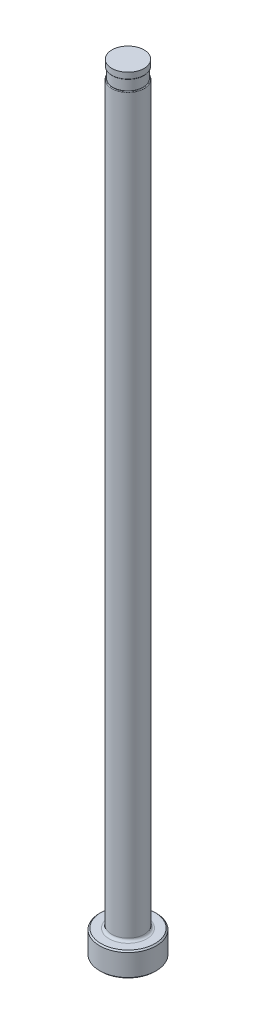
ISO-10303-21;
HEADER;
FILE_DESCRIPTION(('STEP AP214'),'2;1');
FILE_NAME('part.step','',(''),(''),'','','');
FILE_SCHEMA(('AUTOMOTIVE_DESIGN { 1 0 10303 214 1 1 1 1 }'));
ENDSEC;
DATA;
#1=APPLICATION_CONTEXT('core data for automotive mechanical design processes');
#2=APPLICATION_PROTOCOL_DEFINITION('international standard','automotive_design',2000,#1);
#3=PRODUCT_CONTEXT('',#1,'mechanical');
#4=PRODUCT('Part','Part','',(#3));
#5=PRODUCT_RELATED_PRODUCT_CATEGORY('part','',(#4));
#6=PRODUCT_DEFINITION_FORMATION('','',#4);
#7=PRODUCT_DEFINITION_CONTEXT('part definition',#1,'design');
#8=PRODUCT_DEFINITION('design','',#6,#7);
#9=PRODUCT_DEFINITION_SHAPE('','',#8);
#10=(LENGTH_UNIT() NAMED_UNIT(*) SI_UNIT(.MILLI.,.METRE.));
#11=(NAMED_UNIT(*) PLANE_ANGLE_UNIT() SI_UNIT($,.RADIAN.));
#12=(NAMED_UNIT(*) SI_UNIT($,.STERADIAN.) SOLID_ANGLE_UNIT());
#13=UNCERTAINTY_MEASURE_WITH_UNIT(LENGTH_MEASURE(1.E-05),#10,'distance_accuracy_value','');
#14=(GEOMETRIC_REPRESENTATION_CONTEXT(3) GLOBAL_UNCERTAINTY_ASSIGNED_CONTEXT((#13)) GLOBAL_UNIT_ASSIGNED_CONTEXT((#10,
#11,#12)) REPRESENTATION_CONTEXT('',''));
#15=CARTESIAN_POINT('',(0.,0.,0.));
#16=DIRECTION('',(0.,0.,1.));
#17=DIRECTION('',(1.,0.,0.));
#18=AXIS2_PLACEMENT_3D('',#15,#16,#17);
#19=CARTESIAN_POINT('',(-3.17499999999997,151.13,0.));
#20=DIRECTION('',(0.,1.,0.));
#21=DIRECTION('',(0.,0.,1.));
#22=AXIS2_PLACEMENT_3D('',#19,#20,#21);
#23=PLANE('',#22);
#24=CARTESIAN_POINT('',(0.,151.13,0.));
#25=DIRECTION('',(0.,1.,0.));
#26=DIRECTION('',(0.,0.,1.));
#27=AXIS2_PLACEMENT_3D('',#24,#25,#26);
#28=CIRCLE('',#27,3.02894999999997);
#29=CARTESIAN_POINT('',(0.,151.13,3.02894999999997));
#30=VERTEX_POINT('',#29);
#31=EDGE_CURVE('E11',#30,#30,#28,.F.);
#32=ORIENTED_EDGE('',*,*,#31,.T.);
#33=EDGE_LOOP('',(#32));
#34=FACE_BOUND('',#33,.T.);
#35=CARTESIAN_POINT('',(0.,151.13,0.));
#36=DIRECTION('',(0.,1.,0.));
#37=DIRECTION('',(0.,0.,1.));
#38=AXIS2_PLACEMENT_3D('',#35,#36,#37);
#39=CIRCLE('',#38,2.97179999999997);
#40=CARTESIAN_POINT('',(0.,151.13,2.97179999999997));
#41=VERTEX_POINT('',#40);
#42=EDGE_CURVE('E78',#41,#41,#39,.T.);
#43=ORIENTED_EDGE('',*,*,#42,.T.);
#44=EDGE_LOOP('',(#43));
#45=FACE_BOUND('',#44,.T.);
#46=ADVANCED_FACE('F36',(#34,#45),#23,.F.);
#47=CARTESIAN_POINT('',(0.,259.958771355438,0.));
#48=DIRECTION('',(0.,1.,0.));
#49=DIRECTION('',(0.,0.,1.));
#50=AXIS2_PLACEMENT_3D('',#47,#48,#49);
#51=CYLINDRICAL_SURFACE('',#50,3.17499999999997);
#52=DIRECTION('',(0.,1.,0.));
#53=VECTOR('',#52,1.);
#54=CARTESIAN_POINT('',(-2.97179999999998,259.958771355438,-1.11759999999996));
#55=LINE('',#54,#53);
#56=CARTESIAN_POINT('',(-2.97179999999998,148.971,-1.11759999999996));
#57=VERTEX_POINT('',#56);
#58=CARTESIAN_POINT('',(-2.97179999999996,86.614,-1.11760000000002));
#59=VERTEX_POINT('',#58);
#60=EDGE_CURVE('E73',#57,#59,#55,.F.);
#61=ORIENTED_EDGE('',*,*,#60,.F.);
#62=CARTESIAN_POINT('',(0.,148.971,0.));
#63=DIRECTION('',(0.,-1.,0.));
#64=DIRECTION('',(0.,0.,-1.));
#65=AXIS2_PLACEMENT_3D('',#62,#63,#64);
#66=CIRCLE('',#65,3.17499999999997);
#67=CARTESIAN_POINT('',(-2.97179999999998,148.971,1.11759999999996));
#68=VERTEX_POINT('',#67);
#69=EDGE_CURVE('E51',#57,#68,#66,.T.);
#70=ORIENTED_EDGE('',*,*,#69,.T.);
#71=DIRECTION('',(0.,1.,0.));
#72=VECTOR('',#71,1.);
#73=CARTESIAN_POINT('',(-2.97179999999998,259.958771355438,1.11759999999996));
#74=LINE('',#73,#72);
#75=CARTESIAN_POINT('',(-2.97179999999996,86.614,1.11760000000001));
#76=VERTEX_POINT('',#75);
#77=EDGE_CURVE('E84',#76,#68,#74,.T.);
#78=ORIENTED_EDGE('',*,*,#77,.F.);
#79=CARTESIAN_POINT('',(-2.97179999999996,86.614,-1.11760000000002));
#80=CARTESIAN_POINT('',(-2.97179783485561,86.5828492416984,-1.11759841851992));
#81=CARTESIAN_POINT('',(-2.97225900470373,86.5517131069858,-1.11638031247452));
#82=CARTESIAN_POINT('',(-2.97408412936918,86.4896581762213,-1.11151181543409));
#83=CARTESIAN_POINT('',(-2.9754480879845,86.4587393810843,-1.10786141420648));
#84=CARTESIAN_POINT('',(-2.98085437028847,86.3666586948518,-1.09327356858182));
#85=CARTESIAN_POINT('',(-2.98621120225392,86.3061035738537,-1.07869946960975));
#86=CARTESIAN_POINT('',(-2.99989040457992,86.1884361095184,-1.0400472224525));
#87=CARTESIAN_POINT('',(-3.0082151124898,86.131326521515,-1.01596158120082));
#88=CARTESIAN_POINT('',(-3.02694285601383,86.022241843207,-0.958720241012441));
#89=CARTESIAN_POINT('',(-3.03734492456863,85.9702643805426,-0.925568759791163));
#90=CARTESIAN_POINT('',(-3.0590244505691,85.8732383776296,-0.851164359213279));
#91=CARTESIAN_POINT('',(-3.07029576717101,85.828146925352,-0.809965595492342));
#92=CARTESIAN_POINT('',(-3.09254226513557,85.7456893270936,-0.720370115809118));
#93=CARTESIAN_POINT('',(-3.10351739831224,85.7083244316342,-0.671972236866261));
#94=CARTESIAN_POINT('',(-3.12390298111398,85.6424529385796,-0.569694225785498));
#95=CARTESIAN_POINT('',(-3.13332395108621,85.6138855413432,-0.515855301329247));
#96=CARTESIAN_POINT('',(-3.14970808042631,85.5658047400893,-0.403931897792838));
#97=CARTESIAN_POINT('',(-3.15667118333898,85.5462915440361,-0.345847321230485));
#98=CARTESIAN_POINT('',(-3.16748231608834,85.5164813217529,-0.226501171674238));
#99=CARTESIAN_POINT('',(-3.171300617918,85.5062721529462,-0.165214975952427));
#100=CARTESIAN_POINT('',(-3.17532797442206,85.4955133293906,-0.0416799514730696));
#101=CARTESIAN_POINT('',(-3.17553664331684,85.4949647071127,0.0205689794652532));
#102=CARTESIAN_POINT('',(-3.17230405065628,85.5035855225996,0.145017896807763));
#103=CARTESIAN_POINT('',(-3.16882082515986,85.5128666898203,0.207209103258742));
#104=CARTESIAN_POINT('',(-3.15849643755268,85.5412036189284,0.329033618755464));
#105=CARTESIAN_POINT('',(-3.15165544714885,85.5602588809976,0.388667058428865));
#106=CARTESIAN_POINT('',(-3.13536379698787,85.6077683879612,0.503459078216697));
#107=CARTESIAN_POINT('',(-3.12592155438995,85.6361923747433,0.558631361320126));
#108=CARTESIAN_POINT('',(-3.10544176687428,85.7018905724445,0.663093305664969));
#109=CARTESIAN_POINT('',(-3.0944044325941,85.7391636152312,0.712383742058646));
#110=CARTESIAN_POINT('',(-3.07210838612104,85.821112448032,0.803076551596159));
#111=CARTESIAN_POINT('',(-3.06085457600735,85.8656831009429,0.844575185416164));
#112=CARTESIAN_POINT('',(-3.03920760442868,85.9613924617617,0.919437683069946));
#113=CARTESIAN_POINT('',(-3.02881454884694,86.012531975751,0.95280054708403));
#114=CARTESIAN_POINT('',(-3.01003274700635,86.1197633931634,1.01056985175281));
#115=CARTESIAN_POINT('',(-3.00163816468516,86.1758402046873,1.03500248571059));
#116=CARTESIAN_POINT('',(-2.987687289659,86.2914874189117,1.0746137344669));
#117=CARTESIAN_POINT('',(-2.98212915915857,86.3510555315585,1.08979834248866));
#118=CARTESIAN_POINT('',(-2.97612776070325,86.4449133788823,1.10603958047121));
#119=CARTESIAN_POINT('',(-2.97450869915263,86.478597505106,1.11037745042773));
#120=CARTESIAN_POINT('',(-2.97234395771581,86.5461830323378,1.11615426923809));
#121=CARTESIAN_POINT('',(-2.97179623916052,86.580083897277,1.1175987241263));
#122=CARTESIAN_POINT('',(-2.97179999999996,86.614,1.11760000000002));
#123=B_SPLINE_CURVE_WITH_KNOTS('',3,(#79,#80,#81,#82,#83,#84,#85,#86,#87,#88,#89,#90,#91,#92,
#93,#94,#95,#96,#97,#98,#99,#100,#101,#102,#103,#104,#105,#106,#107,#108,#109,#110,#111,#112,
#113,#114,#115,#116,#117,#118,#119,#120,#121,#122),.UNSPECIFIED.,.F.,.F.,(4,2,2,2,2,2,2,2,2,2,2,
2,2,2,2,2,2,2,2,2,2,4),(0.,0.0933958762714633,0.186792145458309,0.373380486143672,
0.56011611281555,0.746765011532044,0.932198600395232,1.11766217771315,1.30181365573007,
1.48596936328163,1.67184654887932,1.85774359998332,2.04577654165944,2.23379986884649,
2.42122179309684,2.60861899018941,2.7935218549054,2.97844743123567,3.162826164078,
3.34708528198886,3.448962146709,3.55064495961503),.UNSPECIFIED.);
#124=EDGE_CURVE('E81',#59,#76,#123,.T.);
#125=ORIENTED_EDGE('',*,*,#124,.F.);
#126=EDGE_LOOP('',(#61,#70,#78,#125));
#127=FACE_BOUND('',#126,.T.);
#128=CARTESIAN_POINT('',(0.,5.25779999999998,0.));
#129=DIRECTION('',(0.,1.,0.));
#130=DIRECTION('',(0.,0.,1.));
#131=AXIS2_PLACEMENT_3D('',#128,#129,#130);
#132=CIRCLE('',#131,3.17499999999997);
#133=CARTESIAN_POINT('',(0.,5.25779999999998,3.17499999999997));
#134=VERTEX_POINT('',#133);
#135=EDGE_CURVE('E116',#134,#134,#132,.T.);
#136=ORIENTED_EDGE('',*,*,#135,.T.);
#137=EDGE_LOOP('',(#136));
#138=FACE_BOUND('',#137,.T.);
#139=ADVANCED_FACE('F82',(#127,#138),#51,.T.);
#140=CARTESIAN_POINT('',(0.,0.,0.));
#141=DIRECTION('',(0.,-1.,0.));
#142=DIRECTION('',(0.,0.,-1.));
#143=AXIS2_PLACEMENT_3D('',#140,#141,#142);
#144=PLANE('',#143);
#145=CARTESIAN_POINT('',(0.,0.,0.));
#146=DIRECTION('',(0.,-1.,0.));
#147=DIRECTION('',(0.,0.,-1.));
#148=AXIS2_PLACEMENT_3D('',#145,#146,#147);
#149=CIRCLE('',#148,5.29589999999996);
#150=CARTESIAN_POINT('',(0.,0.,-5.29589999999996));
#151=VERTEX_POINT('',#150);
#152=EDGE_CURVE('E113',#151,#151,#149,.T.);
#153=ORIENTED_EDGE('',*,*,#152,.T.);
#154=EDGE_LOOP('',(#153));
#155=FACE_BOUND('',#154,.T.);
#156=ADVANCED_FACE('F192',(#155),#144,.T.);
#157=CARTESIAN_POINT('',(0.,259.958771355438,0.));
#158=DIRECTION('',(0.,1.,0.));
#159=DIRECTION('',(0.,0.,1.));
#160=AXIS2_PLACEMENT_3D('',#157,#158,#159);
#161=CYLINDRICAL_SURFACE('',#160,5.54989999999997);
#162=CARTESIAN_POINT('',(0.,4.49579999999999,0.));
#163=DIRECTION('',(0.,1.,0.));
#164=DIRECTION('',(0.,0.,1.));
#165=AXIS2_PLACEMENT_3D('',#162,#163,#164);
#166=CIRCLE('',#165,5.54989999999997);
#167=CARTESIAN_POINT('',(0.,4.49579999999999,5.54989999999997));
#168=VERTEX_POINT('',#167);
#169=EDGE_CURVE('E110',#168,#168,#166,.F.);
#170=ORIENTED_EDGE('',*,*,#169,.T.);
#171=EDGE_LOOP('',(#170));
#172=FACE_BOUND('',#171,.T.);
#173=CARTESIAN_POINT('',(0.,0.253999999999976,0.));
#174=DIRECTION('',(0.,-1.,0.));
#175=DIRECTION('',(0.,0.,-1.));
#176=AXIS2_PLACEMENT_3D('',#173,#174,#175);
#177=CIRCLE('',#176,5.54989999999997);
#178=CARTESIAN_POINT('',(0.,0.253999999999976,-5.54989999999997));
#179=VERTEX_POINT('',#178);
#180=EDGE_CURVE('E107',#179,#179,#177,.F.);
#181=ORIENTED_EDGE('',*,*,#180,.T.);
#182=EDGE_LOOP('',(#181));
#183=FACE_BOUND('',#182,.T.);
#184=ADVANCED_FACE('F195',(#172,#183),#161,.T.);
#185=CARTESIAN_POINT('',(-5.54989999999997,4.7498,0.));
#186=DIRECTION('',(0.,1.,0.));
#187=DIRECTION('',(0.,0.,1.));
#188=AXIS2_PLACEMENT_3D('',#185,#186,#187);
#189=PLANE('',#188);
#190=CARTESIAN_POINT('',(0.,4.7498,0.));
#191=DIRECTION('',(0.,1.,0.));
#192=DIRECTION('',(0.,0.,1.));
#193=AXIS2_PLACEMENT_3D('',#190,#191,#192);
#194=CIRCLE('',#193,3.68299999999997);
#195=CARTESIAN_POINT('',(0.,4.7498,3.68299999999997));
#196=VERTEX_POINT('',#195);
#197=EDGE_CURVE('E87',#196,#196,#194,.F.);
#198=ORIENTED_EDGE('',*,*,#197,.T.);
#199=EDGE_LOOP('',(#198));
#200=FACE_BOUND('',#199,.T.);
#201=CARTESIAN_POINT('',(0.,4.7498,0.));
#202=DIRECTION('',(0.,1.,0.));
#203=DIRECTION('',(0.,0.,1.));
#204=AXIS2_PLACEMENT_3D('',#201,#202,#203);
#205=CIRCLE('',#204,5.29589999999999);
#206=CARTESIAN_POINT('',(0.,4.7498,5.29589999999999));
#207=VERTEX_POINT('',#206);
#208=EDGE_CURVE('E104',#207,#207,#205,.T.);
#209=ORIENTED_EDGE('',*,*,#208,.T.);
#210=EDGE_LOOP('',(#209));
#211=FACE_BOUND('',#210,.T.);
#212=ADVANCED_FACE('F190',(#200,#211),#189,.T.);
#213=CARTESIAN_POINT('',(0.,4.74980000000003,0.));
#214=DIRECTION('',(0.,-1.,0.));
#215=DIRECTION('',(0.,0.,-1.));
#216=AXIS2_PLACEMENT_3D('',#213,#214,#215);
#217=CONICAL_SURFACE('',#216,5.29589999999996,0.785398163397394);
#218=ORIENTED_EDGE('',*,*,#169,.F.);
#219=EDGE_LOOP('',(#218));
#220=FACE_BOUND('',#219,.T.);
#221=ORIENTED_EDGE('',*,*,#208,.F.);
#222=EDGE_LOOP('',(#221));
#223=FACE_BOUND('',#222,.T.);
#224=ADVANCED_FACE('F186',(#220,#223),#217,.T.);
#225=CARTESIAN_POINT('',(0.,0.253999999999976,0.));
#226=DIRECTION('',(0.,1.,0.));
#227=DIRECTION('',(0.,0.,1.));
#228=AXIS2_PLACEMENT_3D('',#225,#226,#227);
#229=CONICAL_SURFACE('',#228,5.54989999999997,0.785398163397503);
#230=ORIENTED_EDGE('',*,*,#152,.F.);
#231=EDGE_LOOP('',(#230));
#232=FACE_BOUND('',#231,.T.);
#233=ORIENTED_EDGE('',*,*,#180,.F.);
#234=EDGE_LOOP('',(#233));
#235=FACE_BOUND('',#234,.T.);
#236=ADVANCED_FACE('F182',(#232,#235),#229,.T.);
#237=CARTESIAN_POINT('',(0.,5.25779999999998,0.));
#238=DIRECTION('',(0.,1.,0.));
#239=DIRECTION('',(0.,0.,1.));
#240=AXIS2_PLACEMENT_3D('',#237,#238,#239);
#241=TOROIDAL_SURFACE('',#240,3.68299999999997,0.508);
#242=ORIENTED_EDGE('',*,*,#197,.F.);
#243=EDGE_LOOP('',(#242));
#244=FACE_BOUND('',#243,.T.);
#245=ORIENTED_EDGE('',*,*,#135,.F.);
#246=EDGE_LOOP('',(#245));
#247=FACE_BOUND('',#246,.T.);
#248=ADVANCED_FACE('F147',(#244,#247),#241,.F.);
#249=CARTESIAN_POINT('',(-3.17499999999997,149.098,0.));
#250=DIRECTION('',(0.,-1.,0.));
#251=DIRECTION('',(0.,0.,-1.));
#252=AXIS2_PLACEMENT_3D('',#249,#250,#251);
#253=PLANE('',#252);
#254=DIRECTION('',(0.,0.,1.));
#255=VECTOR('',#254,1.);
#256=CARTESIAN_POINT('',(-2.97179999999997,149.098,0.));
#257=LINE('',#256,#255);
#258=CARTESIAN_POINT('',(-2.97179999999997,149.098,0.));
#259=VERTEX_POINT('',#258);
#260=CARTESIAN_POINT('',(-2.97179999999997,149.098,0.677280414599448));
#261=VERTEX_POINT('',#260);
#262=EDGE_CURVE('E90',#259,#261,#257,.T.);
#263=ORIENTED_EDGE('',*,*,#262,.T.);
#264=CARTESIAN_POINT('',(0.,149.098,0.));
#265=DIRECTION('',(0.,-1.,0.));
#266=DIRECTION('',(0.,0.,-1.));
#267=AXIS2_PLACEMENT_3D('',#264,#265,#266);
#268=CIRCLE('',#267,3.04799999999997);
#269=CARTESIAN_POINT('',(-2.97179999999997,149.098,-0.677280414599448));
#270=VERTEX_POINT('',#269);
#271=EDGE_CURVE('E86',#261,#270,#268,.F.);
#272=ORIENTED_EDGE('',*,*,#271,.T.);
#273=EDGE_CURVE('E79',#270,#259,#257,.T.);
#274=ORIENTED_EDGE('',*,*,#273,.T.);
#275=CARTESIAN_POINT('',(0.,149.098,0.));
#276=DIRECTION('',(0.,1.,0.));
#277=DIRECTION('',(0.,0.,1.));
#278=AXIS2_PLACEMENT_3D('',#275,#276,#277);
#279=CIRCLE('',#278,2.97179999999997);
#280=EDGE_CURVE('E101',#259,#259,#279,.T.);
#281=ORIENTED_EDGE('',*,*,#280,.F.);
#282=EDGE_LOOP('',(#263,#272,#274,#281));
#283=FACE_BOUND('',#282,.T.);
#284=ADVANCED_FACE('F144',(#283),#253,.F.);
#285=CARTESIAN_POINT('',(0.,153.448281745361,0.));
#286=DIRECTION('',(0.,1.,0.));
#287=DIRECTION('',(0.,0.,1.));
#288=AXIS2_PLACEMENT_3D('',#285,#286,#287);
#289=CYLINDRICAL_SURFACE('',#288,2.97179999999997);
#290=ORIENTED_EDGE('',*,*,#42,.F.);
#291=EDGE_LOOP('',(#290));
#292=FACE_BOUND('',#291,.T.);
#293=ORIENTED_EDGE('',*,*,#280,.T.);
#294=EDGE_LOOP('',(#293));
#295=FACE_BOUND('',#294,.T.);
#296=ADVANCED_FACE('F141',(#292,#295),#289,.T.);
#297=CARTESIAN_POINT('',(-2.97179999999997,150.114,-5.54989999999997));
#298=DIRECTION('',(1.,0.,0.));
#299=DIRECTION('',(0.,1.,0.));
#300=AXIS2_PLACEMENT_3D('',#297,#298,#299);
#301=PLANE('',#300);
#302=ORIENTED_EDGE('',*,*,#273,.F.);
#303=CARTESIAN_POINT('',(-2.97179999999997,149.098,-0.677280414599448));
#304=CARTESIAN_POINT('',(-2.97179999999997,149.097991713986,-0.6984954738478));
#305=CARTESIAN_POINT('',(-2.97179999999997,149.097736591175,-0.719716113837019));
#306=CARTESIAN_POINT('',(-2.97179999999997,149.096538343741,-0.762179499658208));
#307=CARTESIAN_POINT('',(-2.97179999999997,149.095593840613,-0.783422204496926));
#308=CARTESIAN_POINT('',(-2.97179999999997,149.092820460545,-0.825863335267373));
#309=CARTESIAN_POINT('',(-2.97179999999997,149.090991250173,-0.847061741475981));
#310=CARTESIAN_POINT('',(-2.97179999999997,149.086151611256,-0.88931041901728));
#311=CARTESIAN_POINT('',(-2.97179999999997,149.083141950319,-0.91036077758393));
#312=CARTESIAN_POINT('',(-2.97179999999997,149.075222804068,-0.953695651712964));
#313=CARTESIAN_POINT('',(-2.97179999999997,149.070192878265,-0.975960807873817));
#314=CARTESIAN_POINT('',(-2.97179999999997,149.060052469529,-1.00993113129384));
#315=CARTESIAN_POINT('',(-2.97179999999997,149.055967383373,-1.02193961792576));
#316=CARTESIAN_POINT('',(-2.97179999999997,149.046509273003,-1.04542724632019));
#317=CARTESIAN_POINT('',(-2.97179999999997,149.041141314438,-1.0569082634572));
#318=CARTESIAN_POINT('',(-2.97179999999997,149.032361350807,-1.07197645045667));
#319=CARTESIAN_POINT('',(-2.97179999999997,149.029794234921,-1.07605240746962));
#320=CARTESIAN_POINT('',(-2.97179999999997,149.024297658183,-1.08396863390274));
#321=CARTESIAN_POINT('',(-2.97179999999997,149.021367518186,-1.08780844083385));
#322=CARTESIAN_POINT('',(-2.97179999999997,149.015038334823,-1.09516229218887));
#323=CARTESIAN_POINT('',(-2.97179999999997,149.01163441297,-1.09867221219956));
#324=CARTESIAN_POINT('',(-2.97179999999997,149.004296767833,-1.10509067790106));
#325=CARTESIAN_POINT('',(-2.97179999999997,149.000365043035,-1.10800139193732));
#326=CARTESIAN_POINT('',(-2.97179999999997,148.993688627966,-1.11185537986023));
#327=CARTESIAN_POINT('',(-2.97179999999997,148.991127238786,-1.11311410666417));
#328=CARTESIAN_POINT('',(-2.97179999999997,148.985839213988,-1.11520642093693));
#329=CARTESIAN_POINT('',(-2.97179999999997,148.983113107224,-1.11604129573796));
#330=CARTESIAN_POINT('',(-2.97179999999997,148.97880351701,-1.11694468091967));
#331=CARTESIAN_POINT('',(-2.97179999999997,148.977255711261,-1.11718896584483));
#332=CARTESIAN_POINT('',(-2.97179999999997,148.974139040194,-1.11751723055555));
#333=CARTESIAN_POINT('',(-2.97179999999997,148.972570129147,-1.11760077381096));
#334=CARTESIAN_POINT('',(-2.97179999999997,148.971,-1.11760000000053));
#335=B_SPLINE_CURVE_WITH_KNOTS('',3,(#303,#304,#305,#306,#307,#308,#309,#310,#311,#312,#313,
#314,#315,#316,#317,#318,#319,#320,#321,#322,#323,#324,#325,#326,#327,#328,#329,#330,#331,#332,
#333,#334),.UNSPECIFIED.,.F.,.F.,(4,2,2,2,2,2,2,2,2,2,2,2,2,2,2,4),(0.,0.063651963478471,
0.127431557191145,0.191235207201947,0.254997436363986,0.323318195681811,0.361333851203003,
0.399201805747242,0.413638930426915,0.42810348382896,0.442729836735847,0.457302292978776,
0.46583575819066,0.474343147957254,0.479036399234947,0.48374237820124),.UNSPECIFIED.);
#336=EDGE_CURVE('E59',#270,#57,#335,.T.);
#337=ORIENTED_EDGE('',*,*,#336,.T.);
#338=ORIENTED_EDGE('',*,*,#60,.T.);
#339=DIRECTION('',(0.,0.,1.));
#340=VECTOR('',#339,1.);
#341=CARTESIAN_POINT('',(-2.97179999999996,86.614,-5.54989999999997));
#342=LINE('',#341,#340);
#343=EDGE_CURVE('E77',#59,#76,#342,.T.);
#344=ORIENTED_EDGE('',*,*,#343,.T.);
#345=ORIENTED_EDGE('',*,*,#77,.T.);
#346=CARTESIAN_POINT('',(-2.97179999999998,148.971,1.11759999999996));
#347=CARTESIAN_POINT('',(-2.97179999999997,148.973844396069,1.11760835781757));
#348=CARTESIAN_POINT('',(-2.97179999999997,148.97667736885,1.11732895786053));
#349=CARTESIAN_POINT('',(-2.97179999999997,148.982214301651,1.11627315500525));
#350=CARTESIAN_POINT('',(-2.97179999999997,148.984919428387,1.11550297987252));
#351=CARTESIAN_POINT('',(-2.97179999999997,148.990802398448,1.11330388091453));
#352=CARTESIAN_POINT('',(-2.97179999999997,148.993936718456,1.1117608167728));
#353=CARTESIAN_POINT('',(-2.97179999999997,148.99992747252,1.10819062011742));
#354=CARTESIAN_POINT('',(-2.97179999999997,149.002782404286,1.10616105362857));
#355=CARTESIAN_POINT('',(-2.97179999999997,149.010003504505,1.10031059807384));
#356=CARTESIAN_POINT('',(-2.97179999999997,149.014124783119,1.09619100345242));
#357=CARTESIAN_POINT('',(-2.97179999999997,149.021733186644,1.0874137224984));
#358=CARTESIAN_POINT('',(-2.97179999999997,149.025218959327,1.08275492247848));
#359=CARTESIAN_POINT('',(-2.97179999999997,149.036988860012,1.06527198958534));
#360=CARTESIAN_POINT('',(-2.97179999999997,149.043843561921,1.0515049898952));
#361=CARTESIAN_POINT('',(-2.97179999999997,149.055670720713,1.02308851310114));
#362=CARTESIAN_POINT('',(-2.97179999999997,149.060618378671,1.00843010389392));
#363=CARTESIAN_POINT('',(-2.97179999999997,149.072630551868,0.966883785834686));
#364=CARTESIAN_POINT('',(-2.97179999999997,149.078231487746,0.939575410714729));
#365=CARTESIAN_POINT('',(-2.97179999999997,149.086982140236,0.884515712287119));
#366=CARTESIAN_POINT('',(-2.97179999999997,149.090121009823,0.8567629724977));
#367=CARTESIAN_POINT('',(-2.97179999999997,149.094504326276,0.803619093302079));
#368=CARTESIAN_POINT('',(-2.97179999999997,149.095893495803,0.778239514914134));
#369=CARTESIAN_POINT('',(-2.97179999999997,149.097627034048,0.727660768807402));
#370=CARTESIAN_POINT('',(-2.97179999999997,149.097980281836,0.702461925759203));
#371=CARTESIAN_POINT('',(-2.97179999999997,149.098,0.67728041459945));
#372=B_SPLINE_CURVE_WITH_KNOTS('',3,(#346,#347,#348,#349,#350,#351,#352,#353,#354,#355,#356,
#357,#358,#359,#360,#361,#362,#363,#364,#365,#366,#367,#368,#369,#370,#371),.UNSPECIFIED.,.F.,
.F.,(4,2,2,2,2,2,2,2,2,2,2,2,4),(0.,0.00850110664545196,0.0168964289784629,0.0273183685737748,
0.0377935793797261,0.0551763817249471,0.0725957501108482,0.118380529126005,0.164742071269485,
0.248117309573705,0.331857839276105,0.408083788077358,0.483654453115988),.UNSPECIFIED.);
#373=EDGE_CURVE('E172',#68,#261,#372,.T.);
#374=ORIENTED_EDGE('',*,*,#373,.T.);
#375=ORIENTED_EDGE('',*,*,#262,.F.);
#376=EDGE_LOOP('',(#302,#337,#338,#344,#345,#374,#375));
#377=FACE_BOUND('',#376,.T.);
#378=ADVANCED_FACE('F75',(#377),#301,.F.);
#379=CARTESIAN_POINT('',(-6.14679999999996,86.614,-5.54989999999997));
#380=DIRECTION('',(0.,0.,1.));
#381=DIRECTION('',(1.,0.,0.));
#382=AXIS2_PLACEMENT_3D('',#379,#380,#381);
#383=CYLINDRICAL_SURFACE('',#382,3.175);
#384=ORIENTED_EDGE('',*,*,#343,.F.);
#385=ORIENTED_EDGE('',*,*,#124,.T.);
#386=EDGE_LOOP('',(#384,#385));
#387=FACE_BOUND('',#386,.T.);
#388=ADVANCED_FACE('F89',(#387),#383,.F.);
#389=CARTESIAN_POINT('',(0.,152.687735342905,0.));
#390=DIRECTION('',(0.,1.,0.));
#391=DIRECTION('',(0.,0.,1.));
#392=AXIS2_PLACEMENT_3D('',#389,#390,#391);
#393=CYLINDRICAL_SURFACE('',#392,3.15594999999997);
#394=CARTESIAN_POINT('',(0.,151.257,0.));
#395=DIRECTION('',(0.,1.,0.));
#396=DIRECTION('',(0.,0.,1.));
#397=AXIS2_PLACEMENT_3D('',#394,#395,#396);
#398=CIRCLE('',#397,3.15594999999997);
#399=CARTESIAN_POINT('',(0.,151.257,3.15594999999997));
#400=VERTEX_POINT('',#399);
#401=EDGE_CURVE('E44',#400,#400,#398,.T.);
#402=ORIENTED_EDGE('',*,*,#401,.T.);
#403=EDGE_LOOP('',(#402));
#404=FACE_BOUND('',#403,.T.);
#405=CARTESIAN_POINT('',(0.,152.4,0.));
#406=DIRECTION('',(0.,1.,0.));
#407=DIRECTION('',(0.,0.,1.));
#408=AXIS2_PLACEMENT_3D('',#405,#406,#407);
#409=CIRCLE('',#408,3.15594999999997);
#410=CARTESIAN_POINT('',(0.,152.4,3.15594999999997));
#411=VERTEX_POINT('',#410);
#412=EDGE_CURVE('E91',#411,#411,#409,.T.);
#413=ORIENTED_EDGE('',*,*,#412,.F.);
#414=EDGE_LOOP('',(#413));
#415=FACE_BOUND('',#414,.T.);
#416=ADVANCED_FACE('F135',(#404,#415),#393,.T.);
#417=CARTESIAN_POINT('',(-3.17499999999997,152.4,0.));
#418=DIRECTION('',(0.,1.,0.));
#419=DIRECTION('',(0.,0.,1.));
#420=AXIS2_PLACEMENT_3D('',#417,#418,#419);
#421=PLANE('',#420);
#422=ORIENTED_EDGE('',*,*,#412,.T.);
#423=EDGE_LOOP('',(#422));
#424=FACE_BOUND('',#423,.T.);
#425=ADVANCED_FACE('F149',(#424),#421,.T.);
#426=CARTESIAN_POINT('',(0.,148.971,0.));
#427=DIRECTION('',(0.,-1.,0.));
#428=DIRECTION('',(0.,0.,-1.));
#429=AXIS2_PLACEMENT_3D('',#426,#427,#428);
#430=TOROIDAL_SURFACE('',#429,3.04799999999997,0.127);
#431=ORIENTED_EDGE('',*,*,#373,.F.);
#432=ORIENTED_EDGE('',*,*,#69,.F.);
#433=ORIENTED_EDGE('',*,*,#336,.F.);
#434=ORIENTED_EDGE('',*,*,#271,.F.);
#435=EDGE_LOOP('',(#431,#432,#433,#434));
#436=FACE_BOUND('',#435,.T.);
#437=ADVANCED_FACE('F151',(#436),#430,.T.);
#438=CARTESIAN_POINT('',(0.,151.257,0.));
#439=DIRECTION('',(0.,1.,0.));
#440=DIRECTION('',(0.,0.,1.));
#441=AXIS2_PLACEMENT_3D('',#438,#439,#440);
#442=TOROIDAL_SURFACE('',#441,3.02894999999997,0.127);
#443=ORIENTED_EDGE('',*,*,#31,.F.);
#444=EDGE_LOOP('',(#443));
#445=FACE_BOUND('',#444,.T.);
#446=ORIENTED_EDGE('',*,*,#401,.F.);
#447=EDGE_LOOP('',(#446));
#448=FACE_BOUND('',#447,.T.);
#449=ADVANCED_FACE('F38',(#445,#448),#442,.T.);
#450=CLOSED_SHELL('',(#46,#139,#156,#184,#212,#224,#236,#248,#284,#296,#378,#388,#416,#425,#437,#449));
#451=MANIFOLD_SOLID_BREP('B2',#450);
#452=ADVANCED_BREP_SHAPE_REPRESENTATION('',(#18,#451),#14);
#453=SHAPE_DEFINITION_REPRESENTATION(#9,#452);
ENDSEC;
END-ISO-10303-21;
